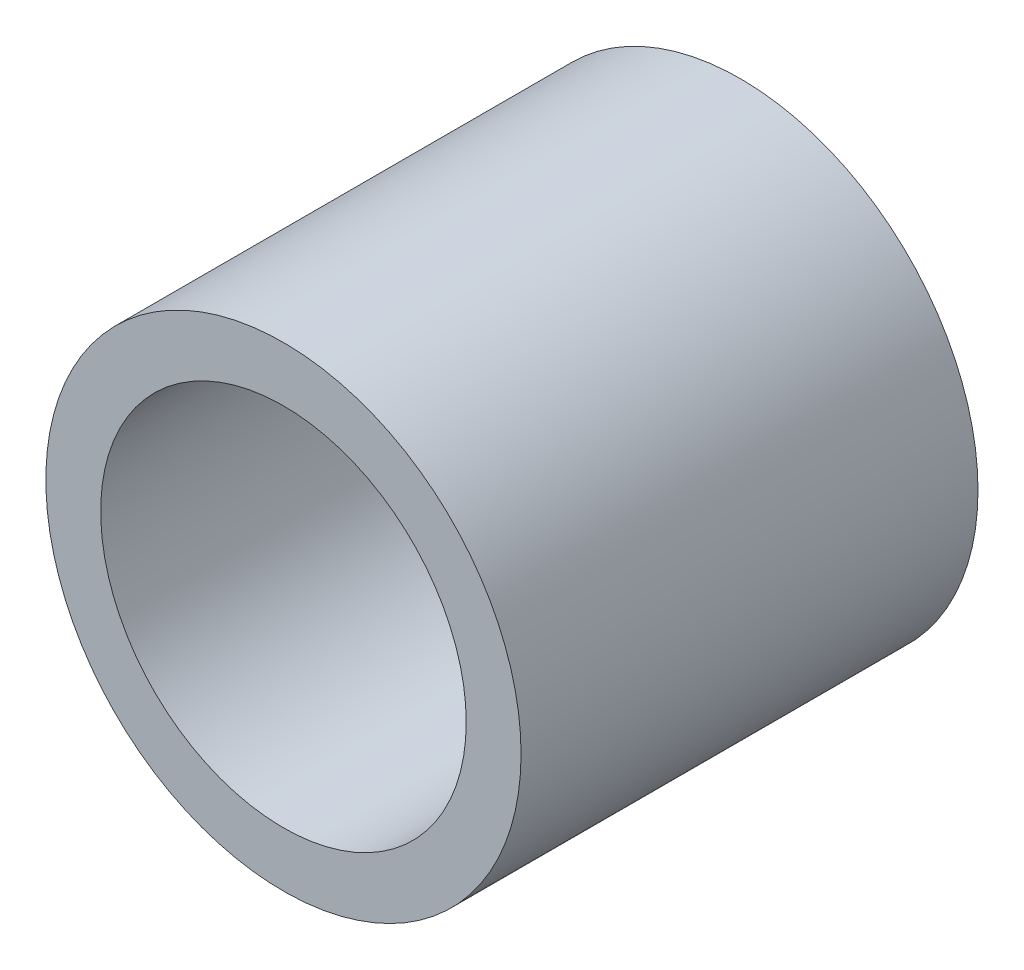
ISO-10303-21;
HEADER;
FILE_DESCRIPTION(('STEP AP214'),'2;1');
FILE_NAME('part.step','',(''),(''),'','','');
FILE_SCHEMA(('AUTOMOTIVE_DESIGN { 1 0 10303 214 1 1 1 1 }'));
ENDSEC;
DATA;
#1=APPLICATION_CONTEXT('core data for automotive mechanical design processes');
#2=APPLICATION_PROTOCOL_DEFINITION('international standard','automotive_design',2000,#1);
#3=PRODUCT_CONTEXT('',#1,'mechanical');
#4=PRODUCT('Part','Part','',(#3));
#5=PRODUCT_RELATED_PRODUCT_CATEGORY('part','',(#4));
#6=PRODUCT_DEFINITION_FORMATION('','',#4);
#7=PRODUCT_DEFINITION_CONTEXT('part definition',#1,'design');
#8=PRODUCT_DEFINITION('design','',#6,#7);
#9=PRODUCT_DEFINITION_SHAPE('','',#8);
#10=(LENGTH_UNIT() NAMED_UNIT(*) SI_UNIT(.MILLI.,.METRE.));
#11=(NAMED_UNIT(*) PLANE_ANGLE_UNIT() SI_UNIT($,.RADIAN.));
#12=(NAMED_UNIT(*) SI_UNIT($,.STERADIAN.) SOLID_ANGLE_UNIT());
#13=UNCERTAINTY_MEASURE_WITH_UNIT(LENGTH_MEASURE(1.E-05),#10,'distance_accuracy_value','');
#14=(GEOMETRIC_REPRESENTATION_CONTEXT(3) GLOBAL_UNCERTAINTY_ASSIGNED_CONTEXT((#13)) GLOBAL_UNIT_ASSIGNED_CONTEXT((#10,
#11,#12)) REPRESENTATION_CONTEXT('',''));
#15=CARTESIAN_POINT('',(0.,0.,0.));
#16=DIRECTION('',(0.,0.,1.));
#17=DIRECTION('',(1.,0.,0.));
#18=AXIS2_PLACEMENT_3D('',#15,#16,#17);
#19=CARTESIAN_POINT('',(0.,0.,12.5));
#20=DIRECTION('',(0.,0.,1.));
#21=DIRECTION('',(1.,0.,0.));
#22=AXIS2_PLACEMENT_3D('',#19,#20,#21);
#23=PLANE('',#22);
#24=CARTESIAN_POINT('',(0.,0.,12.5));
#25=DIRECTION('',(0.,0.,1.));
#26=DIRECTION('',(1.,0.,0.));
#27=AXIS2_PLACEMENT_3D('',#24,#25,#26);
#28=CIRCLE('',#27,13.);
#29=CARTESIAN_POINT('',(13.,0.,12.5));
#30=VERTEX_POINT('',#29);
#31=EDGE_CURVE('E10',#30,#30,#28,.T.);
#32=ORIENTED_EDGE('',*,*,#31,.T.);
#33=EDGE_LOOP('',(#32));
#34=FACE_BOUND('',#33,.T.);
#35=CARTESIAN_POINT('',(0.,0.,12.5));
#36=DIRECTION('',(0.,0.,1.));
#37=DIRECTION('',(1.,0.,0.));
#38=AXIS2_PLACEMENT_3D('',#35,#36,#37);
#39=CIRCLE('',#38,10.);
#40=CARTESIAN_POINT('',(10.,0.,12.5));
#41=VERTEX_POINT('',#40);
#42=EDGE_CURVE('E43',#41,#41,#39,.T.);
#43=ORIENTED_EDGE('',*,*,#42,.F.);
#44=EDGE_LOOP('',(#43));
#45=FACE_BOUND('',#44,.T.);
#46=ADVANCED_FACE('F32',(#34,#45),#23,.T.);
#47=CARTESIAN_POINT('',(0.,0.,-12.5));
#48=DIRECTION('',(0.,0.,1.));
#49=DIRECTION('',(1.,0.,0.));
#50=AXIS2_PLACEMENT_3D('',#47,#48,#49);
#51=PLANE('',#50);
#52=CARTESIAN_POINT('',(0.,0.,-12.5));
#53=DIRECTION('',(0.,0.,1.));
#54=DIRECTION('',(1.,0.,0.));
#55=AXIS2_PLACEMENT_3D('',#52,#53,#54);
#56=CIRCLE('',#55,13.);
#57=CARTESIAN_POINT('',(13.,0.,-12.5));
#58=VERTEX_POINT('',#57);
#59=EDGE_CURVE('E39',#58,#58,#56,.T.);
#60=ORIENTED_EDGE('',*,*,#59,.F.);
#61=EDGE_LOOP('',(#60));
#62=FACE_BOUND('',#61,.T.);
#63=CARTESIAN_POINT('',(0.,0.,-12.5));
#64=DIRECTION('',(0.,0.,1.));
#65=DIRECTION('',(1.,0.,0.));
#66=AXIS2_PLACEMENT_3D('',#63,#64,#65);
#67=CIRCLE('',#66,10.);
#68=CARTESIAN_POINT('',(10.,0.,-12.5));
#69=VERTEX_POINT('',#68);
#70=EDGE_CURVE('E47',#69,#69,#67,.T.);
#71=ORIENTED_EDGE('',*,*,#70,.T.);
#72=EDGE_LOOP('',(#71));
#73=FACE_BOUND('',#72,.T.);
#74=ADVANCED_FACE('F53',(#62,#73),#51,.F.);
#75=CARTESIAN_POINT('',(0.,0.,12.5));
#76=DIRECTION('',(0.,0.,-1.));
#77=DIRECTION('',(-1.,0.,0.));
#78=AXIS2_PLACEMENT_3D('',#75,#76,#77);
#79=CYLINDRICAL_SURFACE('',#78,13.);
#80=ORIENTED_EDGE('',*,*,#31,.F.);
#81=EDGE_LOOP('',(#80));
#82=FACE_BOUND('',#81,.T.);
#83=ORIENTED_EDGE('',*,*,#59,.T.);
#84=EDGE_LOOP('',(#83));
#85=FACE_BOUND('',#84,.T.);
#86=ADVANCED_FACE('F34',(#82,#85),#79,.T.);
#87=CARTESIAN_POINT('',(0.,0.,12.5));
#88=DIRECTION('',(0.,0.,-1.));
#89=DIRECTION('',(-1.,0.,0.));
#90=AXIS2_PLACEMENT_3D('',#87,#88,#89);
#91=CYLINDRICAL_SURFACE('',#90,10.);
#92=ORIENTED_EDGE('',*,*,#42,.T.);
#93=EDGE_LOOP('',(#92));
#94=FACE_BOUND('',#93,.T.);
#95=ORIENTED_EDGE('',*,*,#70,.F.);
#96=EDGE_LOOP('',(#95));
#97=FACE_BOUND('',#96,.T.);
#98=ADVANCED_FACE('F55',(#94,#97),#91,.F.);
#99=CLOSED_SHELL('',(#46,#74,#86,#98));
#100=MANIFOLD_SOLID_BREP('B2',#99);
#101=ADVANCED_BREP_SHAPE_REPRESENTATION('',(#18,#100),#14);
#102=SHAPE_DEFINITION_REPRESENTATION(#9,#101);
ENDSEC;
END-ISO-10303-21;
